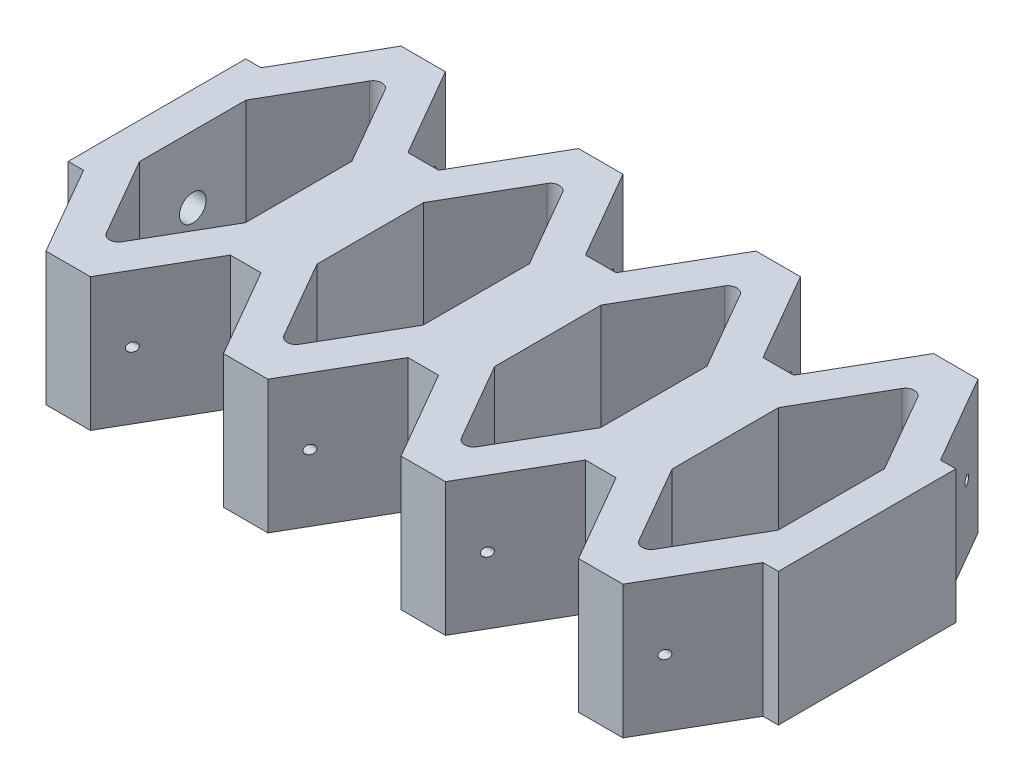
from build123d import *

# Parameters (mm, degrees)
BOSS_EXTRUDE1_DEPTH = 15
LPATTERN1_COUNT     = 4
LPATTERN1_PITCH     = 20
SKETCH2_R           = 0.5
CUT_EXTRUDE1_DEPTH  = 84.815273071
CUT_EXTRUDE2_REACH  = 85.815
SKETCH3_R           = 1.5


with BuildPart() as part:
    # Sketch1 → Boss-Extrude1 (new body)
    with BuildSketch(Plane(origin=(0, 0, 0), x_dir=(1, 0, 0), z_dir=(0, 1, 0))):
        Polygon((0, 10), (1.726497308, 10), (7.5, 20), (12.5, 20), (18.273502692, 10), (20, 10), (20, -10), (18.273502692, -10), (12.5, -20), (7.5, -20), (1.726497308, -10), (0, -10), align=None)
        with BuildLine():
            Line((4.035898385, 6), (9.133974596, 14.830127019))
            ThreePointArc((9.133974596, 14.830127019), (10, 15.330127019), (10.866025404, 14.830127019))
            Line((10.866025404, 14.830127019), (15.964101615, 6))
            Line((15.964101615, 6), (15.964101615, -6))
            Line((15.964101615, -6), (10.866025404, -14.830127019))
            ThreePointArc((10.866025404, -14.830127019), (10, -15.330127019), (9.133974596, -14.830127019))
            Line((9.133974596, -14.830127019), (4.035898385, -6))
            Line((4.035898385, -6), (4.035898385, 6))
        make_face(mode=Mode.SUBTRACT)
    boss_extrude1 = extrude(amount=BOSS_EXTRUDE1_DEPTH)

    # LPattern1: Boss-Extrude1 ×4
    with Locations(*[(i * LPATTERN1_PITCH, 0, 0) for i in range(1, LPATTERN1_COUNT)]):
        add(boss_extrude1)

    # Sketch2 → Cut-Extrude1 (cut, through all)
    with BuildSketch(Plane(origin=(0, 0, 0), x_dir=(0, 0, -1), z_dir=(1, 0, 0))):
        with Locations(Location((17, 7.5, 0), (0, 0, 180))):
            Circle(SKETCH2_R)
        with Locations(Location((-17, 7.5, 0), (0, 0, 180))):
            Circle(SKETCH2_R)
    extrude(amount=CUT_EXTRUDE1_DEPTH, mode=Mode.SUBTRACT)

    # Sketch3 → Cut-Extrude2 (cut, up to next)
    with BuildSketch(Plane.ZY, mode=Mode.PRIVATE) as cut_extrude2_sk1:
        with Locations((0, 7.5)):
            Circle(SKETCH3_R)
    cut_extrude2_tool1 = extrude(cut_extrude2_sk1.sketch, amount=-CUT_EXTRUDE2_REACH, mode=Mode.PRIVATE) & part.part
    add(cut_extrude2_tool1.solids().sort_by_distance((0, 7.5, 0))[0], mode=Mode.SUBTRACT)


solid = part.part
